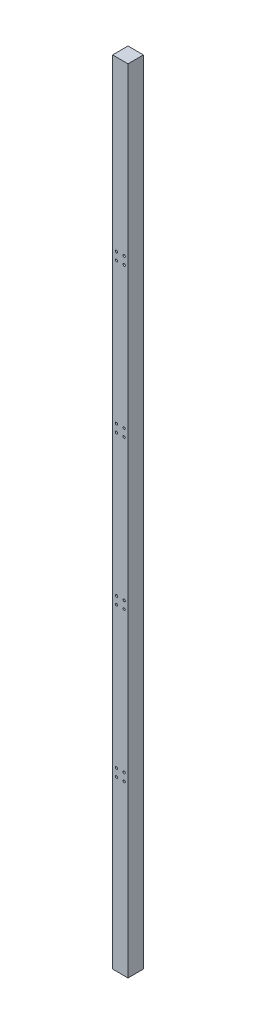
ISO-10303-21;
HEADER;
FILE_DESCRIPTION(('STEP AP214'),'2;1');
FILE_NAME('part.step','',(''),(''),'','','');
FILE_SCHEMA(('AUTOMOTIVE_DESIGN { 1 0 10303 214 1 1 1 1 }'));
ENDSEC;
DATA;
#1=APPLICATION_CONTEXT('core data for automotive mechanical design processes');
#2=APPLICATION_PROTOCOL_DEFINITION('international standard','automotive_design',2000,#1);
#3=PRODUCT_CONTEXT('',#1,'mechanical');
#4=PRODUCT('Part','Part','',(#3));
#5=PRODUCT_RELATED_PRODUCT_CATEGORY('part','',(#4));
#6=PRODUCT_DEFINITION_FORMATION('','',#4);
#7=PRODUCT_DEFINITION_CONTEXT('part definition',#1,'design');
#8=PRODUCT_DEFINITION('design','',#6,#7);
#9=PRODUCT_DEFINITION_SHAPE('','',#8);
#10=(LENGTH_UNIT() NAMED_UNIT(*) SI_UNIT(.MILLI.,.METRE.));
#11=(NAMED_UNIT(*) PLANE_ANGLE_UNIT() SI_UNIT($,.RADIAN.));
#12=(NAMED_UNIT(*) SI_UNIT($,.STERADIAN.) SOLID_ANGLE_UNIT());
#13=UNCERTAINTY_MEASURE_WITH_UNIT(LENGTH_MEASURE(1.E-05),#10,'distance_accuracy_value','');
#14=(GEOMETRIC_REPRESENTATION_CONTEXT(3) GLOBAL_UNCERTAINTY_ASSIGNED_CONTEXT((#13)) GLOBAL_UNIT_ASSIGNED_CONTEXT((#10,
#11,#12)) REPRESENTATION_CONTEXT('',''));
#15=CARTESIAN_POINT('',(0.,0.,0.));
#16=DIRECTION('',(0.,0.,1.));
#17=DIRECTION('',(1.,0.,0.));
#18=AXIS2_PLACEMENT_3D('',#15,#16,#17);
#19=CARTESIAN_POINT('',(-30.,3080.,-30.));
#20=DIRECTION('',(0.,0.,1.));
#21=DIRECTION('',(1.,0.,0.));
#22=AXIS2_PLACEMENT_3D('',#19,#20,#21);
#23=PLANE('',#22);
#24=CARTESIAN_POINT('',(-15.,655.,-30.));
#25=DIRECTION('',(0.,0.,-1.));
#26=DIRECTION('',(-1.,0.,0.));
#27=AXIS2_PLACEMENT_3D('',#24,#25,#26);
#28=CIRCLE('',#27,7.5);
#29=CARTESIAN_POINT('',(-22.5,655.,-30.));
#30=VERTEX_POINT('',#29);
#31=EDGE_CURVE('E309',#30,#30,#28,.T.);
#32=ORIENTED_EDGE('',*,*,#31,.F.);
#33=EDGE_LOOP('',(#32));
#34=FACE_BOUND('',#33,.T.);
#35=CARTESIAN_POINT('',(15.,655.,-30.));
#36=DIRECTION('',(0.,0.,-1.));
#37=DIRECTION('',(-1.,0.,0.));
#38=AXIS2_PLACEMENT_3D('',#35,#36,#37);
#39=CIRCLE('',#38,7.5);
#40=CARTESIAN_POINT('',(7.5,655.,-30.));
#41=VERTEX_POINT('',#40);
#42=EDGE_CURVE('E297',#41,#41,#39,.T.);
#43=ORIENTED_EDGE('',*,*,#42,.F.);
#44=EDGE_LOOP('',(#43));
#45=FACE_BOUND('',#44,.T.);
#46=CARTESIAN_POINT('',(15.0000000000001,685.,-30.));
#47=DIRECTION('',(0.,0.,-1.));
#48=DIRECTION('',(-1.,0.,0.));
#49=AXIS2_PLACEMENT_3D('',#46,#47,#48);
#50=CIRCLE('',#49,7.5);
#51=CARTESIAN_POINT('',(7.50000000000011,685.,-30.));
#52=VERTEX_POINT('',#51);
#53=EDGE_CURVE('E285',#52,#52,#50,.T.);
#54=ORIENTED_EDGE('',*,*,#53,.F.);
#55=EDGE_LOOP('',(#54));
#56=FACE_BOUND('',#55,.T.);
#57=CARTESIAN_POINT('',(-14.9999999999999,685.,-30.));
#58=DIRECTION('',(0.,0.,-1.));
#59=DIRECTION('',(-1.,0.,0.));
#60=AXIS2_PLACEMENT_3D('',#57,#58,#59);
#61=CIRCLE('',#60,7.5);
#62=CARTESIAN_POINT('',(-22.4999999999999,685.,-30.));
#63=VERTEX_POINT('',#62);
#64=EDGE_CURVE('E273',#63,#63,#61,.T.);
#65=ORIENTED_EDGE('',*,*,#64,.F.);
#66=EDGE_LOOP('',(#65));
#67=FACE_BOUND('',#66,.T.);
#68=CARTESIAN_POINT('',(15.0000000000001,1235.,-30.));
#69=DIRECTION('',(0.,0.,-1.));
#70=DIRECTION('',(-1.,0.,0.));
#71=AXIS2_PLACEMENT_3D('',#68,#69,#70);
#72=CIRCLE('',#71,7.49999999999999);
#73=CARTESIAN_POINT('',(7.50000000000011,1235.,-30.));
#74=VERTEX_POINT('',#73);
#75=EDGE_CURVE('E249',#74,#74,#72,.T.);
#76=ORIENTED_EDGE('',*,*,#75,.F.);
#77=EDGE_LOOP('',(#76));
#78=FACE_BOUND('',#77,.T.);
#79=CARTESIAN_POINT('',(15.0000000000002,1265.,-30.));
#80=DIRECTION('',(0.,0.,-1.));
#81=DIRECTION('',(-1.,0.,0.));
#82=AXIS2_PLACEMENT_3D('',#79,#80,#81);
#83=CIRCLE('',#82,7.49999999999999);
#84=CARTESIAN_POINT('',(7.50000000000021,1265.,-30.));
#85=VERTEX_POINT('',#84);
#86=EDGE_CURVE('E237',#85,#85,#83,.T.);
#87=ORIENTED_EDGE('',*,*,#86,.F.);
#88=EDGE_LOOP('',(#87));
#89=FACE_BOUND('',#88,.T.);
#90=CARTESIAN_POINT('',(-14.9999999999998,1265.,-30.));
#91=DIRECTION('',(0.,0.,-1.));
#92=DIRECTION('',(-1.,0.,0.));
#93=AXIS2_PLACEMENT_3D('',#90,#91,#92);
#94=CIRCLE('',#93,7.5);
#95=CARTESIAN_POINT('',(-22.4999999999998,1265.,-30.));
#96=VERTEX_POINT('',#95);
#97=EDGE_CURVE('E225',#96,#96,#94,.T.);
#98=ORIENTED_EDGE('',*,*,#97,.F.);
#99=EDGE_LOOP('',(#98));
#100=FACE_BOUND('',#99,.T.);
#101=CARTESIAN_POINT('',(-14.9999999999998,1815.,-30.));
#102=DIRECTION('',(0.,0.,-1.));
#103=DIRECTION('',(-1.,0.,0.));
#104=AXIS2_PLACEMENT_3D('',#101,#102,#103);
#105=CIRCLE('',#104,7.5);
#106=CARTESIAN_POINT('',(-22.4999999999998,1815.,-30.));
#107=VERTEX_POINT('',#106);
#108=EDGE_CURVE('E213',#107,#107,#105,.T.);
#109=ORIENTED_EDGE('',*,*,#108,.F.);
#110=EDGE_LOOP('',(#109));
#111=FACE_BOUND('',#110,.T.);
#112=CARTESIAN_POINT('',(15.0000000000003,1845.,-30.));
#113=DIRECTION('',(0.,0.,-1.));
#114=DIRECTION('',(-1.,0.,0.));
#115=AXIS2_PLACEMENT_3D('',#112,#113,#114);
#116=CIRCLE('',#115,7.5);
#117=CARTESIAN_POINT('',(7.50000000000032,1845.,-30.));
#118=VERTEX_POINT('',#117);
#119=EDGE_CURVE('E189',#118,#118,#116,.T.);
#120=ORIENTED_EDGE('',*,*,#119,.F.);
#121=EDGE_LOOP('',(#120));
#122=FACE_BOUND('',#121,.T.);
#123=CARTESIAN_POINT('',(-14.9999999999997,2395.,-30.));
#124=DIRECTION('',(0.,0.,-1.));
#125=DIRECTION('',(-1.,0.,0.));
#126=AXIS2_PLACEMENT_3D('',#123,#124,#125);
#127=CIRCLE('',#126,7.5);
#128=CARTESIAN_POINT('',(-22.4999999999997,2395.,-30.));
#129=VERTEX_POINT('',#128);
#130=EDGE_CURVE('E165',#129,#129,#127,.T.);
#131=ORIENTED_EDGE('',*,*,#130,.F.);
#132=EDGE_LOOP('',(#131));
#133=FACE_BOUND('',#132,.T.);
#134=CARTESIAN_POINT('',(15.0000000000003,2395.,-30.));
#135=DIRECTION('',(0.,0.,-1.));
#136=DIRECTION('',(-1.,0.,0.));
#137=AXIS2_PLACEMENT_3D('',#134,#135,#136);
#138=CIRCLE('',#137,7.5);
#139=CARTESIAN_POINT('',(7.50000000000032,2395.,-30.));
#140=VERTEX_POINT('',#139);
#141=EDGE_CURVE('E153',#140,#140,#138,.T.);
#142=ORIENTED_EDGE('',*,*,#141,.F.);
#143=EDGE_LOOP('',(#142));
#144=FACE_BOUND('',#143,.T.);
#145=CARTESIAN_POINT('',(15.0000000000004,2425.,-30.));
#146=DIRECTION('',(0.,0.,-1.));
#147=DIRECTION('',(-1.,0.,0.));
#148=AXIS2_PLACEMENT_3D('',#145,#146,#147);
#149=CIRCLE('',#148,7.5);
#150=CARTESIAN_POINT('',(7.50000000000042,2425.,-30.));
#151=VERTEX_POINT('',#150);
#152=EDGE_CURVE('E141',#151,#151,#149,.T.);
#153=ORIENTED_EDGE('',*,*,#152,.F.);
#154=EDGE_LOOP('',(#153));
#155=FACE_BOUND('',#154,.T.);
#156=CARTESIAN_POINT('',(-14.9999999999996,2425.,-30.));
#157=DIRECTION('',(0.,0.,-1.));
#158=DIRECTION('',(-1.,0.,0.));
#159=AXIS2_PLACEMENT_3D('',#156,#157,#158);
#160=CIRCLE('',#159,7.5);
#161=CARTESIAN_POINT('',(-22.4999999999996,2425.,-30.));
#162=VERTEX_POINT('',#161);
#163=EDGE_CURVE('E129',#162,#162,#160,.T.);
#164=ORIENTED_EDGE('',*,*,#163,.F.);
#165=EDGE_LOOP('',(#164));
#166=FACE_BOUND('',#165,.T.);
#167=DIRECTION('',(-1.,0.,0.));
#168=VECTOR('',#167,1.);
#169=CARTESIAN_POINT('',(-30.,0.,-30.));
#170=LINE('',#169,#168);
#171=CARTESIAN_POINT('',(30.,0.,-30.));
#172=VERTEX_POINT('',#171);
#173=CARTESIAN_POINT('',(-30.,0.,-30.));
#174=VERTEX_POINT('',#173);
#175=EDGE_CURVE('E99',#172,#174,#170,.T.);
#176=ORIENTED_EDGE('',*,*,#175,.T.);
#177=DIRECTION('',(0.,-1.,0.));
#178=VECTOR('',#177,1.);
#179=CARTESIAN_POINT('',(-30.,3080.,-30.));
#180=LINE('',#179,#178);
#181=CARTESIAN_POINT('',(-30.,3080.,-30.));
#182=VERTEX_POINT('',#181);
#183=EDGE_CURVE('E52',#182,#174,#180,.T.);
#184=ORIENTED_EDGE('',*,*,#183,.F.);
#185=DIRECTION('',(-1.,0.,0.));
#186=VECTOR('',#185,1.);
#187=CARTESIAN_POINT('',(-30.,3080.,-30.));
#188=LINE('',#187,#186);
#189=CARTESIAN_POINT('',(30.,3080.,-30.));
#190=VERTEX_POINT('',#189);
#191=EDGE_CURVE('E90',#190,#182,#188,.T.);
#192=ORIENTED_EDGE('',*,*,#191,.F.);
#193=DIRECTION('',(0.,-1.,0.));
#194=VECTOR('',#193,1.);
#195=CARTESIAN_POINT('',(30.,3080.,-30.));
#196=LINE('',#195,#194);
#197=EDGE_CURVE('E11',#190,#172,#196,.T.);
#198=ORIENTED_EDGE('',*,*,#197,.T.);
#199=EDGE_LOOP('',(#176,#184,#192,#198));
#200=FACE_BOUND('',#199,.T.);
#201=CARTESIAN_POINT('',(-14.9999999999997,1845.,-30.));
#202=DIRECTION('',(0.,0.,-1.));
#203=DIRECTION('',(-1.,0.,0.));
#204=AXIS2_PLACEMENT_3D('',#201,#202,#203);
#205=CIRCLE('',#204,7.5);
#206=CARTESIAN_POINT('',(-22.4999999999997,1845.,-30.));
#207=VERTEX_POINT('',#206);
#208=EDGE_CURVE('E177',#207,#207,#205,.T.);
#209=ORIENTED_EDGE('',*,*,#208,.F.);
#210=EDGE_LOOP('',(#209));
#211=FACE_BOUND('',#210,.T.);
#212=CARTESIAN_POINT('',(15.0000000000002,1815.,-30.));
#213=DIRECTION('',(0.,0.,-1.));
#214=DIRECTION('',(-1.,0.,0.));
#215=AXIS2_PLACEMENT_3D('',#212,#213,#214);
#216=CIRCLE('',#215,7.5);
#217=CARTESIAN_POINT('',(7.50000000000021,1815.,-30.));
#218=VERTEX_POINT('',#217);
#219=EDGE_CURVE('E201',#218,#218,#216,.T.);
#220=ORIENTED_EDGE('',*,*,#219,.F.);
#221=EDGE_LOOP('',(#220));
#222=FACE_BOUND('',#221,.T.);
#223=CARTESIAN_POINT('',(-14.9999999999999,1235.,-30.));
#224=DIRECTION('',(0.,0.,-1.));
#225=DIRECTION('',(-1.,0.,0.));
#226=AXIS2_PLACEMENT_3D('',#223,#224,#225);
#227=CIRCLE('',#226,7.5);
#228=CARTESIAN_POINT('',(-22.4999999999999,1235.,-30.));
#229=VERTEX_POINT('',#228);
#230=EDGE_CURVE('E261',#229,#229,#227,.T.);
#231=ORIENTED_EDGE('',*,*,#230,.F.);
#232=EDGE_LOOP('',(#231));
#233=FACE_BOUND('',#232,.T.);
#234=ADVANCED_FACE('F43',(#34,#45,#56,#67,#78,#89,#100,#111,#122,#133,#144,#155,#166,#200,#211,
#222,#233),#23,.F.);
#235=CARTESIAN_POINT('',(30.,3080.,-30.));
#236=DIRECTION('',(-1.,0.,0.));
#237=DIRECTION('',(0.,0.,1.));
#238=AXIS2_PLACEMENT_3D('',#235,#236,#237);
#239=PLANE('',#238);
#240=DIRECTION('',(0.,0.,-1.));
#241=VECTOR('',#240,1.);
#242=CARTESIAN_POINT('',(30.,0.,-30.));
#243=LINE('',#242,#241);
#244=CARTESIAN_POINT('',(30.,0.,30.));
#245=VERTEX_POINT('',#244);
#246=EDGE_CURVE('E107',#245,#172,#243,.T.);
#247=ORIENTED_EDGE('',*,*,#246,.T.);
#248=ORIENTED_EDGE('',*,*,#197,.F.);
#249=DIRECTION('',(0.,0.,-1.));
#250=VECTOR('',#249,1.);
#251=CARTESIAN_POINT('',(30.,3080.,-30.));
#252=LINE('',#251,#250);
#253=CARTESIAN_POINT('',(30.,3080.,30.));
#254=VERTEX_POINT('',#253);
#255=EDGE_CURVE('E95',#254,#190,#252,.T.);
#256=ORIENTED_EDGE('',*,*,#255,.F.);
#257=DIRECTION('',(0.,-1.,0.));
#258=VECTOR('',#257,1.);
#259=CARTESIAN_POINT('',(30.,3080.,30.));
#260=LINE('',#259,#258);
#261=EDGE_CURVE('E103',#254,#245,#260,.T.);
#262=ORIENTED_EDGE('',*,*,#261,.T.);
#263=EDGE_LOOP('',(#247,#248,#256,#262));
#264=FACE_BOUND('',#263,.T.);
#265=ADVANCED_FACE('F45',(#264),#239,.F.);
#266=CARTESIAN_POINT('',(-30.,3080.,-30.));
#267=DIRECTION('',(1.,0.,0.));
#268=DIRECTION('',(0.,0.,-1.));
#269=AXIS2_PLACEMENT_3D('',#266,#267,#268);
#270=PLANE('',#269);
#271=DIRECTION('',(0.,0.,1.));
#272=VECTOR('',#271,1.);
#273=CARTESIAN_POINT('',(-30.,0.,-30.));
#274=LINE('',#273,#272);
#275=CARTESIAN_POINT('',(-30.,0.,30.));
#276=VERTEX_POINT('',#275);
#277=EDGE_CURVE('E77',#174,#276,#274,.T.);
#278=ORIENTED_EDGE('',*,*,#277,.T.);
#279=DIRECTION('',(0.,-1.,0.));
#280=VECTOR('',#279,1.);
#281=CARTESIAN_POINT('',(-30.,3080.,30.));
#282=LINE('',#281,#280);
#283=CARTESIAN_POINT('',(-30.,3080.,30.));
#284=VERTEX_POINT('',#283);
#285=EDGE_CURVE('E100',#284,#276,#282,.T.);
#286=ORIENTED_EDGE('',*,*,#285,.F.);
#287=DIRECTION('',(0.,0.,1.));
#288=VECTOR('',#287,1.);
#289=CARTESIAN_POINT('',(-30.,3080.,-30.));
#290=LINE('',#289,#288);
#291=EDGE_CURVE('E93',#182,#284,#290,.T.);
#292=ORIENTED_EDGE('',*,*,#291,.F.);
#293=ORIENTED_EDGE('',*,*,#183,.T.);
#294=EDGE_LOOP('',(#278,#286,#292,#293));
#295=FACE_BOUND('',#294,.T.);
#296=ADVANCED_FACE('F101',(#295),#270,.F.);
#297=CARTESIAN_POINT('',(-30.,3080.,30.));
#298=DIRECTION('',(0.,0.,-1.));
#299=DIRECTION('',(-1.,0.,0.));
#300=AXIS2_PLACEMENT_3D('',#297,#298,#299);
#301=PLANE('',#300);
#302=CARTESIAN_POINT('',(-15.,655.,30.));
#303=DIRECTION('',(0.,0.,-1.));
#304=DIRECTION('',(-1.,0.,0.));
#305=AXIS2_PLACEMENT_3D('',#302,#303,#304);
#306=CIRCLE('',#305,4.49999999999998);
#307=CARTESIAN_POINT('',(-19.5,655.,30.));
#308=VERTEX_POINT('',#307);
#309=EDGE_CURVE('E300',#308,#308,#306,.T.);
#310=ORIENTED_EDGE('',*,*,#309,.T.);
#311=EDGE_LOOP('',(#310));
#312=FACE_BOUND('',#311,.T.);
#313=CARTESIAN_POINT('',(15.,655.,30.));
#314=DIRECTION('',(0.,0.,-1.));
#315=DIRECTION('',(-1.,0.,0.));
#316=AXIS2_PLACEMENT_3D('',#313,#314,#315);
#317=CIRCLE('',#316,4.49999999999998);
#318=CARTESIAN_POINT('',(10.5,655.,30.));
#319=VERTEX_POINT('',#318);
#320=EDGE_CURVE('E288',#319,#319,#317,.T.);
#321=ORIENTED_EDGE('',*,*,#320,.T.);
#322=EDGE_LOOP('',(#321));
#323=FACE_BOUND('',#322,.T.);
#324=CARTESIAN_POINT('',(15.0000000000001,685.,30.));
#325=DIRECTION('',(0.,0.,-1.));
#326=DIRECTION('',(-1.,0.,0.));
#327=AXIS2_PLACEMENT_3D('',#324,#325,#326);
#328=CIRCLE('',#327,4.49999999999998);
#329=CARTESIAN_POINT('',(10.5000000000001,685.,30.));
#330=VERTEX_POINT('',#329);
#331=EDGE_CURVE('E276',#330,#330,#328,.T.);
#332=ORIENTED_EDGE('',*,*,#331,.T.);
#333=EDGE_LOOP('',(#332));
#334=FACE_BOUND('',#333,.T.);
#335=CARTESIAN_POINT('',(-14.9999999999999,685.,30.));
#336=DIRECTION('',(0.,0.,-1.));
#337=DIRECTION('',(-1.,0.,0.));
#338=AXIS2_PLACEMENT_3D('',#335,#336,#337);
#339=CIRCLE('',#338,4.49999999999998);
#340=CARTESIAN_POINT('',(-19.4999999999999,685.,30.));
#341=VERTEX_POINT('',#340);
#342=EDGE_CURVE('E264',#341,#341,#339,.T.);
#343=ORIENTED_EDGE('',*,*,#342,.T.);
#344=EDGE_LOOP('',(#343));
#345=FACE_BOUND('',#344,.T.);
#346=CARTESIAN_POINT('',(-14.9999999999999,1235.,30.));
#347=DIRECTION('',(0.,0.,-1.));
#348=DIRECTION('',(-1.,0.,0.));
#349=AXIS2_PLACEMENT_3D('',#346,#347,#348);
#350=CIRCLE('',#349,4.49999999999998);
#351=CARTESIAN_POINT('',(-19.4999999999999,1235.,30.));
#352=VERTEX_POINT('',#351);
#353=EDGE_CURVE('E252',#352,#352,#350,.T.);
#354=ORIENTED_EDGE('',*,*,#353,.T.);
#355=EDGE_LOOP('',(#354));
#356=FACE_BOUND('',#355,.T.);
#357=CARTESIAN_POINT('',(15.0000000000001,1235.,30.));
#358=DIRECTION('',(0.,0.,-1.));
#359=DIRECTION('',(-1.,0.,0.));
#360=AXIS2_PLACEMENT_3D('',#357,#358,#359);
#361=CIRCLE('',#360,4.49999999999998);
#362=CARTESIAN_POINT('',(10.5000000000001,1235.,30.));
#363=VERTEX_POINT('',#362);
#364=EDGE_CURVE('E240',#363,#363,#361,.T.);
#365=ORIENTED_EDGE('',*,*,#364,.T.);
#366=EDGE_LOOP('',(#365));
#367=FACE_BOUND('',#366,.T.);
#368=CARTESIAN_POINT('',(15.0000000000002,1265.,30.));
#369=DIRECTION('',(0.,0.,-1.));
#370=DIRECTION('',(-1.,0.,0.));
#371=AXIS2_PLACEMENT_3D('',#368,#369,#370);
#372=CIRCLE('',#371,4.49999999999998);
#373=CARTESIAN_POINT('',(10.5000000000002,1265.,30.));
#374=VERTEX_POINT('',#373);
#375=EDGE_CURVE('E228',#374,#374,#372,.T.);
#376=ORIENTED_EDGE('',*,*,#375,.T.);
#377=EDGE_LOOP('',(#376));
#378=FACE_BOUND('',#377,.T.);
#379=CARTESIAN_POINT('',(-14.9999999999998,1265.,30.));
#380=DIRECTION('',(0.,0.,-1.));
#381=DIRECTION('',(-1.,0.,0.));
#382=AXIS2_PLACEMENT_3D('',#379,#380,#381);
#383=CIRCLE('',#382,4.49999999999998);
#384=CARTESIAN_POINT('',(-19.4999999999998,1265.,30.));
#385=VERTEX_POINT('',#384);
#386=EDGE_CURVE('E216',#385,#385,#383,.T.);
#387=ORIENTED_EDGE('',*,*,#386,.T.);
#388=EDGE_LOOP('',(#387));
#389=FACE_BOUND('',#388,.T.);
#390=CARTESIAN_POINT('',(-14.9999999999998,1815.,30.));
#391=DIRECTION('',(0.,0.,-1.));
#392=DIRECTION('',(-1.,0.,0.));
#393=AXIS2_PLACEMENT_3D('',#390,#391,#392);
#394=CIRCLE('',#393,4.49999999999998);
#395=CARTESIAN_POINT('',(-19.4999999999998,1815.,30.));
#396=VERTEX_POINT('',#395);
#397=EDGE_CURVE('E204',#396,#396,#394,.T.);
#398=ORIENTED_EDGE('',*,*,#397,.T.);
#399=EDGE_LOOP('',(#398));
#400=FACE_BOUND('',#399,.T.);
#401=CARTESIAN_POINT('',(15.0000000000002,1815.,30.));
#402=DIRECTION('',(0.,0.,-1.));
#403=DIRECTION('',(-1.,0.,0.));
#404=AXIS2_PLACEMENT_3D('',#401,#402,#403);
#405=CIRCLE('',#404,4.49999999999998);
#406=CARTESIAN_POINT('',(10.5000000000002,1815.,30.));
#407=VERTEX_POINT('',#406);
#408=EDGE_CURVE('E192',#407,#407,#405,.T.);
#409=ORIENTED_EDGE('',*,*,#408,.T.);
#410=EDGE_LOOP('',(#409));
#411=FACE_BOUND('',#410,.T.);
#412=CARTESIAN_POINT('',(15.0000000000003,1845.,30.));
#413=DIRECTION('',(0.,0.,-1.));
#414=DIRECTION('',(-1.,0.,0.));
#415=AXIS2_PLACEMENT_3D('',#412,#413,#414);
#416=CIRCLE('',#415,4.49999999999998);
#417=CARTESIAN_POINT('',(10.5000000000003,1845.,30.));
#418=VERTEX_POINT('',#417);
#419=EDGE_CURVE('E180',#418,#418,#416,.T.);
#420=ORIENTED_EDGE('',*,*,#419,.T.);
#421=EDGE_LOOP('',(#420));
#422=FACE_BOUND('',#421,.T.);
#423=CARTESIAN_POINT('',(-14.9999999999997,1845.,30.));
#424=DIRECTION('',(0.,0.,-1.));
#425=DIRECTION('',(-1.,0.,0.));
#426=AXIS2_PLACEMENT_3D('',#423,#424,#425);
#427=CIRCLE('',#426,4.49999999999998);
#428=CARTESIAN_POINT('',(-19.4999999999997,1845.,30.));
#429=VERTEX_POINT('',#428);
#430=EDGE_CURVE('E168',#429,#429,#427,.T.);
#431=ORIENTED_EDGE('',*,*,#430,.T.);
#432=EDGE_LOOP('',(#431));
#433=FACE_BOUND('',#432,.T.);
#434=CARTESIAN_POINT('',(-14.9999999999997,2395.,30.));
#435=DIRECTION('',(0.,0.,-1.));
#436=DIRECTION('',(-1.,0.,0.));
#437=AXIS2_PLACEMENT_3D('',#434,#435,#436);
#438=CIRCLE('',#437,4.49999999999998);
#439=CARTESIAN_POINT('',(-19.4999999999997,2395.,30.));
#440=VERTEX_POINT('',#439);
#441=EDGE_CURVE('E156',#440,#440,#438,.T.);
#442=ORIENTED_EDGE('',*,*,#441,.T.);
#443=EDGE_LOOP('',(#442));
#444=FACE_BOUND('',#443,.T.);
#445=CARTESIAN_POINT('',(15.0000000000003,2395.,30.));
#446=DIRECTION('',(0.,0.,-1.));
#447=DIRECTION('',(-1.,0.,0.));
#448=AXIS2_PLACEMENT_3D('',#445,#446,#447);
#449=CIRCLE('',#448,4.49999999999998);
#450=CARTESIAN_POINT('',(10.5000000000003,2395.,30.));
#451=VERTEX_POINT('',#450);
#452=EDGE_CURVE('E144',#451,#451,#449,.T.);
#453=ORIENTED_EDGE('',*,*,#452,.T.);
#454=EDGE_LOOP('',(#453));
#455=FACE_BOUND('',#454,.T.);
#456=CARTESIAN_POINT('',(15.0000000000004,2425.,30.));
#457=DIRECTION('',(0.,0.,-1.));
#458=DIRECTION('',(-1.,0.,0.));
#459=AXIS2_PLACEMENT_3D('',#456,#457,#458);
#460=CIRCLE('',#459,4.49999999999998);
#461=CARTESIAN_POINT('',(10.5000000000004,2425.,30.));
#462=VERTEX_POINT('',#461);
#463=EDGE_CURVE('E132',#462,#462,#460,.T.);
#464=ORIENTED_EDGE('',*,*,#463,.T.);
#465=EDGE_LOOP('',(#464));
#466=FACE_BOUND('',#465,.T.);
#467=CARTESIAN_POINT('',(-14.9999999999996,2425.,30.));
#468=DIRECTION('',(0.,0.,-1.));
#469=DIRECTION('',(-1.,0.,0.));
#470=AXIS2_PLACEMENT_3D('',#467,#468,#469);
#471=CIRCLE('',#470,4.49999999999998);
#472=CARTESIAN_POINT('',(-19.4999999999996,2425.,30.));
#473=VERTEX_POINT('',#472);
#474=EDGE_CURVE('E110',#473,#473,#471,.T.);
#475=ORIENTED_EDGE('',*,*,#474,.T.);
#476=EDGE_LOOP('',(#475));
#477=FACE_BOUND('',#476,.T.);
#478=DIRECTION('',(1.,0.,0.));
#479=VECTOR('',#478,1.);
#480=CARTESIAN_POINT('',(-30.,0.,30.));
#481=LINE('',#480,#479);
#482=EDGE_CURVE('E83',#276,#245,#481,.T.);
#483=ORIENTED_EDGE('',*,*,#482,.T.);
#484=ORIENTED_EDGE('',*,*,#261,.F.);
#485=DIRECTION('',(1.,0.,0.));
#486=VECTOR('',#485,1.);
#487=CARTESIAN_POINT('',(-30.,3080.,30.));
#488=LINE('',#487,#486);
#489=EDGE_CURVE('E60',#284,#254,#488,.T.);
#490=ORIENTED_EDGE('',*,*,#489,.F.);
#491=ORIENTED_EDGE('',*,*,#285,.T.);
#492=EDGE_LOOP('',(#483,#484,#490,#491));
#493=FACE_BOUND('',#492,.T.);
#494=ADVANCED_FACE('F115',(#312,#323,#334,#345,#356,#367,#378,#389,#400,#411,#422,#433,#444,
#455,#466,#477,#493),#301,.F.);
#495=CARTESIAN_POINT('',(0.,3080.,0.));
#496=DIRECTION('',(0.,1.,0.));
#497=DIRECTION('',(0.,0.,1.));
#498=AXIS2_PLACEMENT_3D('',#495,#496,#497);
#499=PLANE('',#498);
#500=ORIENTED_EDGE('',*,*,#255,.T.);
#501=ORIENTED_EDGE('',*,*,#191,.T.);
#502=ORIENTED_EDGE('',*,*,#291,.T.);
#503=ORIENTED_EDGE('',*,*,#489,.T.);
#504=EDGE_LOOP('',(#500,#501,#502,#503));
#505=FACE_BOUND('',#504,.T.);
#506=ADVANCED_FACE('F91',(#505),#499,.T.);
#507=CARTESIAN_POINT('',(0.,0.,0.));
#508=DIRECTION('',(0.,1.,0.));
#509=DIRECTION('',(0.,0.,1.));
#510=AXIS2_PLACEMENT_3D('',#507,#508,#509);
#511=PLANE('',#510);
#512=ORIENTED_EDGE('',*,*,#246,.F.);
#513=ORIENTED_EDGE('',*,*,#482,.F.);
#514=ORIENTED_EDGE('',*,*,#277,.F.);
#515=ORIENTED_EDGE('',*,*,#175,.F.);
#516=EDGE_LOOP('',(#512,#513,#514,#515));
#517=FACE_BOUND('',#516,.T.);
#518=ADVANCED_FACE('F118',(#517),#511,.F.);
#519=CARTESIAN_POINT('',(-14.9999999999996,2425.,-30.));
#520=DIRECTION('',(0.,0.,-1.));
#521=DIRECTION('',(-1.,0.,0.));
#522=AXIS2_PLACEMENT_3D('',#519,#520,#521);
#523=CYLINDRICAL_SURFACE('',#522,4.5);
#524=ORIENTED_EDGE('',*,*,#474,.F.);
#525=EDGE_LOOP('',(#524));
#526=FACE_BOUND('',#525,.T.);
#527=CARTESIAN_POINT('',(-14.9999999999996,2425.,-24.));
#528=DIRECTION('',(0.,0.,-1.));
#529=DIRECTION('',(-1.,0.,0.));
#530=AXIS2_PLACEMENT_3D('',#527,#528,#529);
#531=CIRCLE('',#530,4.50000000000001);
#532=CARTESIAN_POINT('',(-19.4999999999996,2425.,-24.));
#533=VERTEX_POINT('',#532);
#534=EDGE_CURVE('E123',#533,#533,#531,.T.);
#535=ORIENTED_EDGE('',*,*,#534,.T.);
#536=EDGE_LOOP('',(#535));
#537=FACE_BOUND('',#536,.T.);
#538=ADVANCED_FACE('F354',(#526,#537),#523,.F.);
#539=CARTESIAN_POINT('',(-10.4999999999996,2425.,-24.));
#540=DIRECTION('',(0.,0.,1.));
#541=DIRECTION('',(1.,0.,0.));
#542=AXIS2_PLACEMENT_3D('',#539,#540,#541);
#543=PLANE('',#542);
#544=ORIENTED_EDGE('',*,*,#534,.F.);
#545=EDGE_LOOP('',(#544));
#546=FACE_BOUND('',#545,.T.);
#547=CARTESIAN_POINT('',(-14.9999999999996,2425.,-24.));
#548=DIRECTION('',(0.,0.,-1.));
#549=DIRECTION('',(-1.,0.,0.));
#550=AXIS2_PLACEMENT_3D('',#547,#548,#549);
#551=CIRCLE('',#550,7.5);
#552=CARTESIAN_POINT('',(-22.4999999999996,2425.,-24.));
#553=VERTEX_POINT('',#552);
#554=EDGE_CURVE('E126',#553,#553,#551,.T.);
#555=ORIENTED_EDGE('',*,*,#554,.T.);
#556=EDGE_LOOP('',(#555));
#557=FACE_BOUND('',#556,.T.);
#558=ADVANCED_FACE('F344',(#546,#557),#543,.F.);
#559=CARTESIAN_POINT('',(-14.9999999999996,2425.,-30.));
#560=DIRECTION('',(0.,0.,-1.));
#561=DIRECTION('',(-1.,0.,0.));
#562=AXIS2_PLACEMENT_3D('',#559,#560,#561);
#563=CYLINDRICAL_SURFACE('',#562,7.5);
#564=ORIENTED_EDGE('',*,*,#554,.F.);
#565=EDGE_LOOP('',(#564));
#566=FACE_BOUND('',#565,.T.);
#567=ORIENTED_EDGE('',*,*,#163,.T.);
#568=EDGE_LOOP('',(#567));
#569=FACE_BOUND('',#568,.T.);
#570=ADVANCED_FACE('F341',(#566,#569),#563,.F.);
#571=CARTESIAN_POINT('',(15.0000000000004,2425.,-30.));
#572=DIRECTION('',(0.,0.,-1.));
#573=DIRECTION('',(-1.,0.,0.));
#574=AXIS2_PLACEMENT_3D('',#571,#572,#573);
#575=CYLINDRICAL_SURFACE('',#574,4.5);
#576=ORIENTED_EDGE('',*,*,#463,.F.);
#577=EDGE_LOOP('',(#576));
#578=FACE_BOUND('',#577,.T.);
#579=CARTESIAN_POINT('',(15.0000000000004,2425.,-24.));
#580=DIRECTION('',(0.,0.,-1.));
#581=DIRECTION('',(-1.,0.,0.));
#582=AXIS2_PLACEMENT_3D('',#579,#580,#581);
#583=CIRCLE('',#582,4.50000000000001);
#584=CARTESIAN_POINT('',(10.5000000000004,2425.,-24.));
#585=VERTEX_POINT('',#584);
#586=EDGE_CURVE('E135',#585,#585,#583,.T.);
#587=ORIENTED_EDGE('',*,*,#586,.T.);
#588=EDGE_LOOP('',(#587));
#589=FACE_BOUND('',#588,.T.);
#590=ADVANCED_FACE('F343',(#578,#589),#575,.F.);
#591=CARTESIAN_POINT('',(19.5000000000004,2425.,-24.));
#592=DIRECTION('',(0.,0.,1.));
#593=DIRECTION('',(1.,0.,0.));
#594=AXIS2_PLACEMENT_3D('',#591,#592,#593);
#595=PLANE('',#594);
#596=ORIENTED_EDGE('',*,*,#586,.F.);
#597=EDGE_LOOP('',(#596));
#598=FACE_BOUND('',#597,.T.);
#599=CARTESIAN_POINT('',(15.0000000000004,2425.,-24.));
#600=DIRECTION('',(0.,0.,-1.));
#601=DIRECTION('',(-1.,0.,0.));
#602=AXIS2_PLACEMENT_3D('',#599,#600,#601);
#603=CIRCLE('',#602,7.5);
#604=CARTESIAN_POINT('',(7.50000000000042,2425.,-24.));
#605=VERTEX_POINT('',#604);
#606=EDGE_CURVE('E138',#605,#605,#603,.T.);
#607=ORIENTED_EDGE('',*,*,#606,.T.);
#608=EDGE_LOOP('',(#607));
#609=FACE_BOUND('',#608,.T.);
#610=ADVANCED_FACE('F351',(#598,#609),#595,.F.);
#611=CARTESIAN_POINT('',(15.0000000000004,2425.,-30.));
#612=DIRECTION('',(0.,0.,-1.));
#613=DIRECTION('',(-1.,0.,0.));
#614=AXIS2_PLACEMENT_3D('',#611,#612,#613);
#615=CYLINDRICAL_SURFACE('',#614,7.5);
#616=ORIENTED_EDGE('',*,*,#606,.F.);
#617=EDGE_LOOP('',(#616));
#618=FACE_BOUND('',#617,.T.);
#619=ORIENTED_EDGE('',*,*,#152,.T.);
#620=EDGE_LOOP('',(#619));
#621=FACE_BOUND('',#620,.T.);
#622=ADVANCED_FACE('F435',(#618,#621),#615,.F.);
#623=CARTESIAN_POINT('',(15.0000000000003,2395.,-30.));
#624=DIRECTION('',(0.,0.,-1.));
#625=DIRECTION('',(-1.,0.,0.));
#626=AXIS2_PLACEMENT_3D('',#623,#624,#625);
#627=CYLINDRICAL_SURFACE('',#626,4.5);
#628=ORIENTED_EDGE('',*,*,#452,.F.);
#629=EDGE_LOOP('',(#628));
#630=FACE_BOUND('',#629,.T.);
#631=CARTESIAN_POINT('',(15.0000000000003,2395.,-24.));
#632=DIRECTION('',(0.,0.,-1.));
#633=DIRECTION('',(-1.,0.,0.));
#634=AXIS2_PLACEMENT_3D('',#631,#632,#633);
#635=CIRCLE('',#634,4.50000000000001);
#636=CARTESIAN_POINT('',(10.5000000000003,2395.,-24.));
#637=VERTEX_POINT('',#636);
#638=EDGE_CURVE('E147',#637,#637,#635,.T.);
#639=ORIENTED_EDGE('',*,*,#638,.T.);
#640=EDGE_LOOP('',(#639));
#641=FACE_BOUND('',#640,.T.);
#642=ADVANCED_FACE('F444',(#630,#641),#627,.F.);
#643=CARTESIAN_POINT('',(19.5000000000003,2395.,-24.));
#644=DIRECTION('',(0.,0.,1.));
#645=DIRECTION('',(1.,0.,0.));
#646=AXIS2_PLACEMENT_3D('',#643,#644,#645);
#647=PLANE('',#646);
#648=ORIENTED_EDGE('',*,*,#638,.F.);
#649=EDGE_LOOP('',(#648));
#650=FACE_BOUND('',#649,.T.);
#651=CARTESIAN_POINT('',(15.0000000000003,2395.,-24.));
#652=DIRECTION('',(0.,0.,-1.));
#653=DIRECTION('',(-1.,0.,0.));
#654=AXIS2_PLACEMENT_3D('',#651,#652,#653);
#655=CIRCLE('',#654,7.5);
#656=CARTESIAN_POINT('',(7.50000000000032,2395.,-24.));
#657=VERTEX_POINT('',#656);
#658=EDGE_CURVE('E150',#657,#657,#655,.T.);
#659=ORIENTED_EDGE('',*,*,#658,.T.);
#660=EDGE_LOOP('',(#659));
#661=FACE_BOUND('',#660,.T.);
#662=ADVANCED_FACE('F454',(#650,#661),#647,.F.);
#663=CARTESIAN_POINT('',(15.0000000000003,2395.,-30.));
#664=DIRECTION('',(0.,0.,-1.));
#665=DIRECTION('',(-1.,0.,0.));
#666=AXIS2_PLACEMENT_3D('',#663,#664,#665);
#667=CYLINDRICAL_SURFACE('',#666,7.5);
#668=ORIENTED_EDGE('',*,*,#658,.F.);
#669=EDGE_LOOP('',(#668));
#670=FACE_BOUND('',#669,.T.);
#671=ORIENTED_EDGE('',*,*,#141,.T.);
#672=EDGE_LOOP('',(#671));
#673=FACE_BOUND('',#672,.T.);
#674=ADVANCED_FACE('F464',(#670,#673),#667,.F.);
#675=CARTESIAN_POINT('',(-14.9999999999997,2395.,-30.));
#676=DIRECTION('',(0.,0.,-1.));
#677=DIRECTION('',(-1.,0.,0.));
#678=AXIS2_PLACEMENT_3D('',#675,#676,#677);
#679=CYLINDRICAL_SURFACE('',#678,4.5);
#680=ORIENTED_EDGE('',*,*,#441,.F.);
#681=EDGE_LOOP('',(#680));
#682=FACE_BOUND('',#681,.T.);
#683=CARTESIAN_POINT('',(-14.9999999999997,2395.,-24.));
#684=DIRECTION('',(0.,0.,-1.));
#685=DIRECTION('',(-1.,0.,0.));
#686=AXIS2_PLACEMENT_3D('',#683,#684,#685);
#687=CIRCLE('',#686,4.50000000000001);
#688=CARTESIAN_POINT('',(-19.4999999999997,2395.,-24.));
#689=VERTEX_POINT('',#688);
#690=EDGE_CURVE('E159',#689,#689,#687,.T.);
#691=ORIENTED_EDGE('',*,*,#690,.T.);
#692=EDGE_LOOP('',(#691));
#693=FACE_BOUND('',#692,.T.);
#694=ADVANCED_FACE('F474',(#682,#693),#679,.F.);
#695=CARTESIAN_POINT('',(-10.4999999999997,2395.,-24.));
#696=DIRECTION('',(0.,0.,1.));
#697=DIRECTION('',(1.,0.,0.));
#698=AXIS2_PLACEMENT_3D('',#695,#696,#697);
#699=PLANE('',#698);
#700=ORIENTED_EDGE('',*,*,#690,.F.);
#701=EDGE_LOOP('',(#700));
#702=FACE_BOUND('',#701,.T.);
#703=CARTESIAN_POINT('',(-14.9999999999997,2395.,-24.));
#704=DIRECTION('',(0.,0.,-1.));
#705=DIRECTION('',(-1.,0.,0.));
#706=AXIS2_PLACEMENT_3D('',#703,#704,#705);
#707=CIRCLE('',#706,7.5);
#708=CARTESIAN_POINT('',(-22.4999999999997,2395.,-24.));
#709=VERTEX_POINT('',#708);
#710=EDGE_CURVE('E162',#709,#709,#707,.T.);
#711=ORIENTED_EDGE('',*,*,#710,.T.);
#712=EDGE_LOOP('',(#711));
#713=FACE_BOUND('',#712,.T.);
#714=ADVANCED_FACE('F484',(#702,#713),#699,.F.);
#715=CARTESIAN_POINT('',(-14.9999999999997,2395.,-30.));
#716=DIRECTION('',(0.,0.,-1.));
#717=DIRECTION('',(-1.,0.,0.));
#718=AXIS2_PLACEMENT_3D('',#715,#716,#717);
#719=CYLINDRICAL_SURFACE('',#718,7.5);
#720=ORIENTED_EDGE('',*,*,#710,.F.);
#721=EDGE_LOOP('',(#720));
#722=FACE_BOUND('',#721,.T.);
#723=ORIENTED_EDGE('',*,*,#130,.T.);
#724=EDGE_LOOP('',(#723));
#725=FACE_BOUND('',#724,.T.);
#726=ADVANCED_FACE('F494',(#722,#725),#719,.F.);
#727=CARTESIAN_POINT('',(-14.9999999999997,1845.,-30.));
#728=DIRECTION('',(0.,0.,-1.));
#729=DIRECTION('',(-1.,0.,0.));
#730=AXIS2_PLACEMENT_3D('',#727,#728,#729);
#731=CYLINDRICAL_SURFACE('',#730,4.5);
#732=ORIENTED_EDGE('',*,*,#430,.F.);
#733=EDGE_LOOP('',(#732));
#734=FACE_BOUND('',#733,.T.);
#735=CARTESIAN_POINT('',(-14.9999999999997,1845.,-24.));
#736=DIRECTION('',(0.,0.,-1.));
#737=DIRECTION('',(-1.,0.,0.));
#738=AXIS2_PLACEMENT_3D('',#735,#736,#737);
#739=CIRCLE('',#738,4.50000000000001);
#740=CARTESIAN_POINT('',(-19.4999999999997,1845.,-24.));
#741=VERTEX_POINT('',#740);
#742=EDGE_CURVE('E171',#741,#741,#739,.T.);
#743=ORIENTED_EDGE('',*,*,#742,.T.);
#744=EDGE_LOOP('',(#743));
#745=FACE_BOUND('',#744,.T.);
#746=ADVANCED_FACE('F504',(#734,#745),#731,.F.);
#747=CARTESIAN_POINT('',(-10.4999999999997,1845.,-24.));
#748=DIRECTION('',(0.,0.,1.));
#749=DIRECTION('',(1.,0.,0.));
#750=AXIS2_PLACEMENT_3D('',#747,#748,#749);
#751=PLANE('',#750);
#752=ORIENTED_EDGE('',*,*,#742,.F.);
#753=EDGE_LOOP('',(#752));
#754=FACE_BOUND('',#753,.T.);
#755=CARTESIAN_POINT('',(-14.9999999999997,1845.,-24.));
#756=DIRECTION('',(0.,0.,-1.));
#757=DIRECTION('',(-1.,0.,0.));
#758=AXIS2_PLACEMENT_3D('',#755,#756,#757);
#759=CIRCLE('',#758,7.5);
#760=CARTESIAN_POINT('',(-22.4999999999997,1845.,-24.));
#761=VERTEX_POINT('',#760);
#762=EDGE_CURVE('E174',#761,#761,#759,.T.);
#763=ORIENTED_EDGE('',*,*,#762,.T.);
#764=EDGE_LOOP('',(#763));
#765=FACE_BOUND('',#764,.T.);
#766=ADVANCED_FACE('F514',(#754,#765),#751,.F.);
#767=CARTESIAN_POINT('',(-14.9999999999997,1845.,-30.));
#768=DIRECTION('',(0.,0.,-1.));
#769=DIRECTION('',(-1.,0.,0.));
#770=AXIS2_PLACEMENT_3D('',#767,#768,#769);
#771=CYLINDRICAL_SURFACE('',#770,7.5);
#772=ORIENTED_EDGE('',*,*,#762,.F.);
#773=EDGE_LOOP('',(#772));
#774=FACE_BOUND('',#773,.T.);
#775=ORIENTED_EDGE('',*,*,#208,.T.);
#776=EDGE_LOOP('',(#775));
#777=FACE_BOUND('',#776,.T.);
#778=ADVANCED_FACE('F524',(#774,#777),#771,.F.);
#779=CARTESIAN_POINT('',(15.0000000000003,1845.,-30.));
#780=DIRECTION('',(0.,0.,-1.));
#781=DIRECTION('',(-1.,0.,0.));
#782=AXIS2_PLACEMENT_3D('',#779,#780,#781);
#783=CYLINDRICAL_SURFACE('',#782,4.5);
#784=ORIENTED_EDGE('',*,*,#419,.F.);
#785=EDGE_LOOP('',(#784));
#786=FACE_BOUND('',#785,.T.);
#787=CARTESIAN_POINT('',(15.0000000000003,1845.,-24.));
#788=DIRECTION('',(0.,0.,-1.));
#789=DIRECTION('',(-1.,0.,0.));
#790=AXIS2_PLACEMENT_3D('',#787,#788,#789);
#791=CIRCLE('',#790,4.50000000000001);
#792=CARTESIAN_POINT('',(10.5000000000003,1845.,-24.));
#793=VERTEX_POINT('',#792);
#794=EDGE_CURVE('E183',#793,#793,#791,.T.);
#795=ORIENTED_EDGE('',*,*,#794,.T.);
#796=EDGE_LOOP('',(#795));
#797=FACE_BOUND('',#796,.T.);
#798=ADVANCED_FACE('F534',(#786,#797),#783,.F.);
#799=CARTESIAN_POINT('',(19.5000000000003,1845.,-24.));
#800=DIRECTION('',(0.,0.,1.));
#801=DIRECTION('',(1.,0.,0.));
#802=AXIS2_PLACEMENT_3D('',#799,#800,#801);
#803=PLANE('',#802);
#804=ORIENTED_EDGE('',*,*,#794,.F.);
#805=EDGE_LOOP('',(#804));
#806=FACE_BOUND('',#805,.T.);
#807=CARTESIAN_POINT('',(15.0000000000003,1845.,-24.));
#808=DIRECTION('',(0.,0.,-1.));
#809=DIRECTION('',(-1.,0.,0.));
#810=AXIS2_PLACEMENT_3D('',#807,#808,#809);
#811=CIRCLE('',#810,7.5);
#812=CARTESIAN_POINT('',(7.50000000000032,1845.,-24.));
#813=VERTEX_POINT('',#812);
#814=EDGE_CURVE('E186',#813,#813,#811,.T.);
#815=ORIENTED_EDGE('',*,*,#814,.T.);
#816=EDGE_LOOP('',(#815));
#817=FACE_BOUND('',#816,.T.);
#818=ADVANCED_FACE('F544',(#806,#817),#803,.F.);
#819=CARTESIAN_POINT('',(15.0000000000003,1845.,-30.));
#820=DIRECTION('',(0.,0.,-1.));
#821=DIRECTION('',(-1.,0.,0.));
#822=AXIS2_PLACEMENT_3D('',#819,#820,#821);
#823=CYLINDRICAL_SURFACE('',#822,7.5);
#824=ORIENTED_EDGE('',*,*,#814,.F.);
#825=EDGE_LOOP('',(#824));
#826=FACE_BOUND('',#825,.T.);
#827=ORIENTED_EDGE('',*,*,#119,.T.);
#828=EDGE_LOOP('',(#827));
#829=FACE_BOUND('',#828,.T.);
#830=ADVANCED_FACE('F554',(#826,#829),#823,.F.);
#831=CARTESIAN_POINT('',(15.0000000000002,1815.,-30.));
#832=DIRECTION('',(0.,0.,-1.));
#833=DIRECTION('',(-1.,0.,0.));
#834=AXIS2_PLACEMENT_3D('',#831,#832,#833);
#835=CYLINDRICAL_SURFACE('',#834,4.5);
#836=ORIENTED_EDGE('',*,*,#408,.F.);
#837=EDGE_LOOP('',(#836));
#838=FACE_BOUND('',#837,.T.);
#839=CARTESIAN_POINT('',(15.0000000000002,1815.,-24.));
#840=DIRECTION('',(0.,0.,-1.));
#841=DIRECTION('',(-1.,0.,0.));
#842=AXIS2_PLACEMENT_3D('',#839,#840,#841);
#843=CIRCLE('',#842,4.50000000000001);
#844=CARTESIAN_POINT('',(10.5000000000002,1815.,-24.));
#845=VERTEX_POINT('',#844);
#846=EDGE_CURVE('E195',#845,#845,#843,.T.);
#847=ORIENTED_EDGE('',*,*,#846,.T.);
#848=EDGE_LOOP('',(#847));
#849=FACE_BOUND('',#848,.T.);
#850=ADVANCED_FACE('F564',(#838,#849),#835,.F.);
#851=CARTESIAN_POINT('',(19.5000000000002,1815.,-24.));
#852=DIRECTION('',(0.,0.,1.));
#853=DIRECTION('',(1.,0.,0.));
#854=AXIS2_PLACEMENT_3D('',#851,#852,#853);
#855=PLANE('',#854);
#856=ORIENTED_EDGE('',*,*,#846,.F.);
#857=EDGE_LOOP('',(#856));
#858=FACE_BOUND('',#857,.T.);
#859=CARTESIAN_POINT('',(15.0000000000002,1815.,-24.));
#860=DIRECTION('',(0.,0.,-1.));
#861=DIRECTION('',(-1.,0.,0.));
#862=AXIS2_PLACEMENT_3D('',#859,#860,#861);
#863=CIRCLE('',#862,7.5);
#864=CARTESIAN_POINT('',(7.50000000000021,1815.,-24.));
#865=VERTEX_POINT('',#864);
#866=EDGE_CURVE('E198',#865,#865,#863,.T.);
#867=ORIENTED_EDGE('',*,*,#866,.T.);
#868=EDGE_LOOP('',(#867));
#869=FACE_BOUND('',#868,.T.);
#870=ADVANCED_FACE('F574',(#858,#869),#855,.F.);
#871=CARTESIAN_POINT('',(15.0000000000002,1815.,-30.));
#872=DIRECTION('',(0.,0.,-1.));
#873=DIRECTION('',(-1.,0.,0.));
#874=AXIS2_PLACEMENT_3D('',#871,#872,#873);
#875=CYLINDRICAL_SURFACE('',#874,7.5);
#876=ORIENTED_EDGE('',*,*,#866,.F.);
#877=EDGE_LOOP('',(#876));
#878=FACE_BOUND('',#877,.T.);
#879=ORIENTED_EDGE('',*,*,#219,.T.);
#880=EDGE_LOOP('',(#879));
#881=FACE_BOUND('',#880,.T.);
#882=ADVANCED_FACE('F584',(#878,#881),#875,.F.);
#883=CARTESIAN_POINT('',(-14.9999999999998,1815.,-30.));
#884=DIRECTION('',(0.,0.,-1.));
#885=DIRECTION('',(-1.,0.,0.));
#886=AXIS2_PLACEMENT_3D('',#883,#884,#885);
#887=CYLINDRICAL_SURFACE('',#886,4.5);
#888=ORIENTED_EDGE('',*,*,#397,.F.);
#889=EDGE_LOOP('',(#888));
#890=FACE_BOUND('',#889,.T.);
#891=CARTESIAN_POINT('',(-14.9999999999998,1815.,-24.));
#892=DIRECTION('',(0.,0.,-1.));
#893=DIRECTION('',(-1.,0.,0.));
#894=AXIS2_PLACEMENT_3D('',#891,#892,#893);
#895=CIRCLE('',#894,4.50000000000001);
#896=CARTESIAN_POINT('',(-19.4999999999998,1815.,-24.));
#897=VERTEX_POINT('',#896);
#898=EDGE_CURVE('E207',#897,#897,#895,.T.);
#899=ORIENTED_EDGE('',*,*,#898,.T.);
#900=EDGE_LOOP('',(#899));
#901=FACE_BOUND('',#900,.T.);
#902=ADVANCED_FACE('F594',(#890,#901),#887,.F.);
#903=CARTESIAN_POINT('',(-10.4999999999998,1815.,-24.));
#904=DIRECTION('',(0.,0.,1.));
#905=DIRECTION('',(1.,0.,0.));
#906=AXIS2_PLACEMENT_3D('',#903,#904,#905);
#907=PLANE('',#906);
#908=ORIENTED_EDGE('',*,*,#898,.F.);
#909=EDGE_LOOP('',(#908));
#910=FACE_BOUND('',#909,.T.);
#911=CARTESIAN_POINT('',(-14.9999999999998,1815.,-24.));
#912=DIRECTION('',(0.,0.,-1.));
#913=DIRECTION('',(-1.,0.,0.));
#914=AXIS2_PLACEMENT_3D('',#911,#912,#913);
#915=CIRCLE('',#914,7.5);
#916=CARTESIAN_POINT('',(-22.4999999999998,1815.,-24.));
#917=VERTEX_POINT('',#916);
#918=EDGE_CURVE('E210',#917,#917,#915,.T.);
#919=ORIENTED_EDGE('',*,*,#918,.T.);
#920=EDGE_LOOP('',(#919));
#921=FACE_BOUND('',#920,.T.);
#922=ADVANCED_FACE('F604',(#910,#921),#907,.F.);
#923=CARTESIAN_POINT('',(-14.9999999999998,1815.,-30.));
#924=DIRECTION('',(0.,0.,-1.));
#925=DIRECTION('',(-1.,0.,0.));
#926=AXIS2_PLACEMENT_3D('',#923,#924,#925);
#927=CYLINDRICAL_SURFACE('',#926,7.5);
#928=ORIENTED_EDGE('',*,*,#918,.F.);
#929=EDGE_LOOP('',(#928));
#930=FACE_BOUND('',#929,.T.);
#931=ORIENTED_EDGE('',*,*,#108,.T.);
#932=EDGE_LOOP('',(#931));
#933=FACE_BOUND('',#932,.T.);
#934=ADVANCED_FACE('F614',(#930,#933),#927,.F.);
#935=CARTESIAN_POINT('',(-14.9999999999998,1265.,-30.));
#936=DIRECTION('',(0.,0.,-1.));
#937=DIRECTION('',(-1.,0.,0.));
#938=AXIS2_PLACEMENT_3D('',#935,#936,#937);
#939=CYLINDRICAL_SURFACE('',#938,4.5);
#940=ORIENTED_EDGE('',*,*,#386,.F.);
#941=EDGE_LOOP('',(#940));
#942=FACE_BOUND('',#941,.T.);
#943=CARTESIAN_POINT('',(-14.9999999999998,1265.,-24.));
#944=DIRECTION('',(0.,0.,-1.));
#945=DIRECTION('',(-1.,0.,0.));
#946=AXIS2_PLACEMENT_3D('',#943,#944,#945);
#947=CIRCLE('',#946,4.50000000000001);
#948=CARTESIAN_POINT('',(-19.4999999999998,1265.,-24.));
#949=VERTEX_POINT('',#948);
#950=EDGE_CURVE('E219',#949,#949,#947,.T.);
#951=ORIENTED_EDGE('',*,*,#950,.T.);
#952=EDGE_LOOP('',(#951));
#953=FACE_BOUND('',#952,.T.);
#954=ADVANCED_FACE('F624',(#942,#953),#939,.F.);
#955=CARTESIAN_POINT('',(-10.4999999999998,1265.,-24.));
#956=DIRECTION('',(0.,0.,1.));
#957=DIRECTION('',(1.,0.,0.));
#958=AXIS2_PLACEMENT_3D('',#955,#956,#957);
#959=PLANE('',#958);
#960=ORIENTED_EDGE('',*,*,#950,.F.);
#961=EDGE_LOOP('',(#960));
#962=FACE_BOUND('',#961,.T.);
#963=CARTESIAN_POINT('',(-14.9999999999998,1265.,-24.));
#964=DIRECTION('',(0.,0.,-1.));
#965=DIRECTION('',(-1.,0.,0.));
#966=AXIS2_PLACEMENT_3D('',#963,#964,#965);
#967=CIRCLE('',#966,7.5);
#968=CARTESIAN_POINT('',(-22.4999999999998,1265.,-24.));
#969=VERTEX_POINT('',#968);
#970=EDGE_CURVE('E222',#969,#969,#967,.T.);
#971=ORIENTED_EDGE('',*,*,#970,.T.);
#972=EDGE_LOOP('',(#971));
#973=FACE_BOUND('',#972,.T.);
#974=ADVANCED_FACE('F634',(#962,#973),#959,.F.);
#975=CARTESIAN_POINT('',(-14.9999999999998,1265.,-30.));
#976=DIRECTION('',(0.,0.,-1.));
#977=DIRECTION('',(-1.,0.,0.));
#978=AXIS2_PLACEMENT_3D('',#975,#976,#977);
#979=CYLINDRICAL_SURFACE('',#978,7.5);
#980=ORIENTED_EDGE('',*,*,#970,.F.);
#981=EDGE_LOOP('',(#980));
#982=FACE_BOUND('',#981,.T.);
#983=ORIENTED_EDGE('',*,*,#97,.T.);
#984=EDGE_LOOP('',(#983));
#985=FACE_BOUND('',#984,.T.);
#986=ADVANCED_FACE('F644',(#982,#985),#979,.F.);
#987=CARTESIAN_POINT('',(15.0000000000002,1265.,-30.));
#988=DIRECTION('',(0.,0.,-1.));
#989=DIRECTION('',(-1.,0.,0.));
#990=AXIS2_PLACEMENT_3D('',#987,#988,#989);
#991=CYLINDRICAL_SURFACE('',#990,4.5);
#992=ORIENTED_EDGE('',*,*,#375,.F.);
#993=EDGE_LOOP('',(#992));
#994=FACE_BOUND('',#993,.T.);
#995=CARTESIAN_POINT('',(15.0000000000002,1265.,-24.));
#996=DIRECTION('',(0.,0.,-1.));
#997=DIRECTION('',(-1.,0.,0.));
#998=AXIS2_PLACEMENT_3D('',#995,#996,#997);
#999=CIRCLE('',#998,4.50000000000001);
#1000=CARTESIAN_POINT('',(10.5000000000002,1265.,-24.));
#1001=VERTEX_POINT('',#1000);
#1002=EDGE_CURVE('E231',#1001,#1001,#999,.T.);
#1003=ORIENTED_EDGE('',*,*,#1002,.T.);
#1004=EDGE_LOOP('',(#1003));
#1005=FACE_BOUND('',#1004,.T.);
#1006=ADVANCED_FACE('F654',(#994,#1005),#991,.F.);
#1007=CARTESIAN_POINT('',(19.5000000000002,1265.,-24.));
#1008=DIRECTION('',(0.,0.,1.));
#1009=DIRECTION('',(1.,0.,0.));
#1010=AXIS2_PLACEMENT_3D('',#1007,#1008,#1009);
#1011=PLANE('',#1010);
#1012=ORIENTED_EDGE('',*,*,#1002,.F.);
#1013=EDGE_LOOP('',(#1012));
#1014=FACE_BOUND('',#1013,.T.);
#1015=CARTESIAN_POINT('',(15.0000000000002,1265.,-24.));
#1016=DIRECTION('',(0.,0.,-1.));
#1017=DIRECTION('',(-1.,0.,0.));
#1018=AXIS2_PLACEMENT_3D('',#1015,#1016,#1017);
#1019=CIRCLE('',#1018,7.49999999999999);
#1020=CARTESIAN_POINT('',(7.50000000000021,1265.,-24.));
#1021=VERTEX_POINT('',#1020);
#1022=EDGE_CURVE('E234',#1021,#1021,#1019,.T.);
#1023=ORIENTED_EDGE('',*,*,#1022,.T.);
#1024=EDGE_LOOP('',(#1023));
#1025=FACE_BOUND('',#1024,.T.);
#1026=ADVANCED_FACE('F664',(#1014,#1025),#1011,.F.);
#1027=CARTESIAN_POINT('',(15.0000000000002,1265.,-30.));
#1028=DIRECTION('',(0.,0.,-1.));
#1029=DIRECTION('',(-1.,0.,0.));
#1030=AXIS2_PLACEMENT_3D('',#1027,#1028,#1029);
#1031=CYLINDRICAL_SURFACE('',#1030,7.49999999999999);
#1032=ORIENTED_EDGE('',*,*,#1022,.F.);
#1033=EDGE_LOOP('',(#1032));
#1034=FACE_BOUND('',#1033,.T.);
#1035=ORIENTED_EDGE('',*,*,#86,.T.);
#1036=EDGE_LOOP('',(#1035));
#1037=FACE_BOUND('',#1036,.T.);
#1038=ADVANCED_FACE('F674',(#1034,#1037),#1031,.F.);
#1039=CARTESIAN_POINT('',(15.0000000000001,1235.,-30.));
#1040=DIRECTION('',(0.,0.,-1.));
#1041=DIRECTION('',(-1.,0.,0.));
#1042=AXIS2_PLACEMENT_3D('',#1039,#1040,#1041);
#1043=CYLINDRICAL_SURFACE('',#1042,4.5);
#1044=ORIENTED_EDGE('',*,*,#364,.F.);
#1045=EDGE_LOOP('',(#1044));
#1046=FACE_BOUND('',#1045,.T.);
#1047=CARTESIAN_POINT('',(15.0000000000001,1235.,-24.));
#1048=DIRECTION('',(0.,0.,-1.));
#1049=DIRECTION('',(-1.,0.,0.));
#1050=AXIS2_PLACEMENT_3D('',#1047,#1048,#1049);
#1051=CIRCLE('',#1050,4.50000000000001);
#1052=CARTESIAN_POINT('',(10.5000000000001,1235.,-24.));
#1053=VERTEX_POINT('',#1052);
#1054=EDGE_CURVE('E243',#1053,#1053,#1051,.T.);
#1055=ORIENTED_EDGE('',*,*,#1054,.T.);
#1056=EDGE_LOOP('',(#1055));
#1057=FACE_BOUND('',#1056,.T.);
#1058=ADVANCED_FACE('F684',(#1046,#1057),#1043,.F.);
#1059=CARTESIAN_POINT('',(19.5000000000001,1235.,-24.));
#1060=DIRECTION('',(0.,0.,1.));
#1061=DIRECTION('',(1.,0.,0.));
#1062=AXIS2_PLACEMENT_3D('',#1059,#1060,#1061);
#1063=PLANE('',#1062);
#1064=ORIENTED_EDGE('',*,*,#1054,.F.);
#1065=EDGE_LOOP('',(#1064));
#1066=FACE_BOUND('',#1065,.T.);
#1067=CARTESIAN_POINT('',(15.0000000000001,1235.,-24.));
#1068=DIRECTION('',(0.,0.,-1.));
#1069=DIRECTION('',(-1.,0.,0.));
#1070=AXIS2_PLACEMENT_3D('',#1067,#1068,#1069);
#1071=CIRCLE('',#1070,7.49999999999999);
#1072=CARTESIAN_POINT('',(7.50000000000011,1235.,-24.));
#1073=VERTEX_POINT('',#1072);
#1074=EDGE_CURVE('E246',#1073,#1073,#1071,.T.);
#1075=ORIENTED_EDGE('',*,*,#1074,.T.);
#1076=EDGE_LOOP('',(#1075));
#1077=FACE_BOUND('',#1076,.T.);
#1078=ADVANCED_FACE('F694',(#1066,#1077),#1063,.F.);
#1079=CARTESIAN_POINT('',(15.0000000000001,1235.,-30.));
#1080=DIRECTION('',(0.,0.,-1.));
#1081=DIRECTION('',(-1.,0.,0.));
#1082=AXIS2_PLACEMENT_3D('',#1079,#1080,#1081);
#1083=CYLINDRICAL_SURFACE('',#1082,7.49999999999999);
#1084=ORIENTED_EDGE('',*,*,#1074,.F.);
#1085=EDGE_LOOP('',(#1084));
#1086=FACE_BOUND('',#1085,.T.);
#1087=ORIENTED_EDGE('',*,*,#75,.T.);
#1088=EDGE_LOOP('',(#1087));
#1089=FACE_BOUND('',#1088,.T.);
#1090=ADVANCED_FACE('F704',(#1086,#1089),#1083,.F.);
#1091=CARTESIAN_POINT('',(-14.9999999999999,1235.,-30.));
#1092=DIRECTION('',(0.,0.,-1.));
#1093=DIRECTION('',(-1.,0.,0.));
#1094=AXIS2_PLACEMENT_3D('',#1091,#1092,#1093);
#1095=CYLINDRICAL_SURFACE('',#1094,4.5);
#1096=ORIENTED_EDGE('',*,*,#353,.F.);
#1097=EDGE_LOOP('',(#1096));
#1098=FACE_BOUND('',#1097,.T.);
#1099=CARTESIAN_POINT('',(-14.9999999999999,1235.,-24.));
#1100=DIRECTION('',(0.,0.,-1.));
#1101=DIRECTION('',(-1.,0.,0.));
#1102=AXIS2_PLACEMENT_3D('',#1099,#1100,#1101);
#1103=CIRCLE('',#1102,4.50000000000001);
#1104=CARTESIAN_POINT('',(-19.4999999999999,1235.,-24.));
#1105=VERTEX_POINT('',#1104);
#1106=EDGE_CURVE('E255',#1105,#1105,#1103,.T.);
#1107=ORIENTED_EDGE('',*,*,#1106,.T.);
#1108=EDGE_LOOP('',(#1107));
#1109=FACE_BOUND('',#1108,.T.);
#1110=ADVANCED_FACE('F714',(#1098,#1109),#1095,.F.);
#1111=CARTESIAN_POINT('',(-10.4999999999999,1235.,-24.));
#1112=DIRECTION('',(0.,0.,1.));
#1113=DIRECTION('',(1.,0.,0.));
#1114=AXIS2_PLACEMENT_3D('',#1111,#1112,#1113);
#1115=PLANE('',#1114);
#1116=ORIENTED_EDGE('',*,*,#1106,.F.);
#1117=EDGE_LOOP('',(#1116));
#1118=FACE_BOUND('',#1117,.T.);
#1119=CARTESIAN_POINT('',(-14.9999999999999,1235.,-24.));
#1120=DIRECTION('',(0.,0.,-1.));
#1121=DIRECTION('',(-1.,0.,0.));
#1122=AXIS2_PLACEMENT_3D('',#1119,#1120,#1121);
#1123=CIRCLE('',#1122,7.5);
#1124=CARTESIAN_POINT('',(-22.4999999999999,1235.,-24.));
#1125=VERTEX_POINT('',#1124);
#1126=EDGE_CURVE('E258',#1125,#1125,#1123,.T.);
#1127=ORIENTED_EDGE('',*,*,#1126,.T.);
#1128=EDGE_LOOP('',(#1127));
#1129=FACE_BOUND('',#1128,.T.);
#1130=ADVANCED_FACE('F724',(#1118,#1129),#1115,.F.);
#1131=CARTESIAN_POINT('',(-14.9999999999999,1235.,-30.));
#1132=DIRECTION('',(0.,0.,-1.));
#1133=DIRECTION('',(-1.,0.,0.));
#1134=AXIS2_PLACEMENT_3D('',#1131,#1132,#1133);
#1135=CYLINDRICAL_SURFACE('',#1134,7.5);
#1136=ORIENTED_EDGE('',*,*,#1126,.F.);
#1137=EDGE_LOOP('',(#1136));
#1138=FACE_BOUND('',#1137,.T.);
#1139=ORIENTED_EDGE('',*,*,#230,.T.);
#1140=EDGE_LOOP('',(#1139));
#1141=FACE_BOUND('',#1140,.T.);
#1142=ADVANCED_FACE('F734',(#1138,#1141),#1135,.F.);
#1143=CARTESIAN_POINT('',(-14.9999999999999,685.,-30.));
#1144=DIRECTION('',(0.,0.,-1.));
#1145=DIRECTION('',(-1.,0.,0.));
#1146=AXIS2_PLACEMENT_3D('',#1143,#1144,#1145);
#1147=CYLINDRICAL_SURFACE('',#1146,4.5);
#1148=ORIENTED_EDGE('',*,*,#342,.F.);
#1149=EDGE_LOOP('',(#1148));
#1150=FACE_BOUND('',#1149,.T.);
#1151=CARTESIAN_POINT('',(-14.9999999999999,685.,-24.));
#1152=DIRECTION('',(0.,0.,-1.));
#1153=DIRECTION('',(-1.,0.,0.));
#1154=AXIS2_PLACEMENT_3D('',#1151,#1152,#1153);
#1155=CIRCLE('',#1154,4.50000000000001);
#1156=CARTESIAN_POINT('',(-19.4999999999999,685.,-24.));
#1157=VERTEX_POINT('',#1156);
#1158=EDGE_CURVE('E267',#1157,#1157,#1155,.T.);
#1159=ORIENTED_EDGE('',*,*,#1158,.T.);
#1160=EDGE_LOOP('',(#1159));
#1161=FACE_BOUND('',#1160,.T.);
#1162=ADVANCED_FACE('F744',(#1150,#1161),#1147,.F.);
#1163=CARTESIAN_POINT('',(-10.4999999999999,685.,-24.));
#1164=DIRECTION('',(0.,0.,1.));
#1165=DIRECTION('',(1.,0.,0.));
#1166=AXIS2_PLACEMENT_3D('',#1163,#1164,#1165);
#1167=PLANE('',#1166);
#1168=ORIENTED_EDGE('',*,*,#1158,.F.);
#1169=EDGE_LOOP('',(#1168));
#1170=FACE_BOUND('',#1169,.T.);
#1171=CARTESIAN_POINT('',(-14.9999999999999,685.,-24.));
#1172=DIRECTION('',(0.,0.,-1.));
#1173=DIRECTION('',(-1.,0.,0.));
#1174=AXIS2_PLACEMENT_3D('',#1171,#1172,#1173);
#1175=CIRCLE('',#1174,7.5);
#1176=CARTESIAN_POINT('',(-22.4999999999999,685.,-24.));
#1177=VERTEX_POINT('',#1176);
#1178=EDGE_CURVE('E270',#1177,#1177,#1175,.T.);
#1179=ORIENTED_EDGE('',*,*,#1178,.T.);
#1180=EDGE_LOOP('',(#1179));
#1181=FACE_BOUND('',#1180,.T.);
#1182=ADVANCED_FACE('F754',(#1170,#1181),#1167,.F.);
#1183=CARTESIAN_POINT('',(-14.9999999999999,685.,-30.));
#1184=DIRECTION('',(0.,0.,-1.));
#1185=DIRECTION('',(-1.,0.,0.));
#1186=AXIS2_PLACEMENT_3D('',#1183,#1184,#1185);
#1187=CYLINDRICAL_SURFACE('',#1186,7.5);
#1188=ORIENTED_EDGE('',*,*,#1178,.F.);
#1189=EDGE_LOOP('',(#1188));
#1190=FACE_BOUND('',#1189,.T.);
#1191=ORIENTED_EDGE('',*,*,#64,.T.);
#1192=EDGE_LOOP('',(#1191));
#1193=FACE_BOUND('',#1192,.T.);
#1194=ADVANCED_FACE('F764',(#1190,#1193),#1187,.F.);
#1195=CARTESIAN_POINT('',(15.0000000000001,685.,-30.));
#1196=DIRECTION('',(0.,0.,-1.));
#1197=DIRECTION('',(-1.,0.,0.));
#1198=AXIS2_PLACEMENT_3D('',#1195,#1196,#1197);
#1199=CYLINDRICAL_SURFACE('',#1198,4.5);
#1200=ORIENTED_EDGE('',*,*,#331,.F.);
#1201=EDGE_LOOP('',(#1200));
#1202=FACE_BOUND('',#1201,.T.);
#1203=CARTESIAN_POINT('',(15.0000000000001,685.,-24.));
#1204=DIRECTION('',(0.,0.,-1.));
#1205=DIRECTION('',(-1.,0.,0.));
#1206=AXIS2_PLACEMENT_3D('',#1203,#1204,#1205);
#1207=CIRCLE('',#1206,4.50000000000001);
#1208=CARTESIAN_POINT('',(10.5000000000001,685.,-24.));
#1209=VERTEX_POINT('',#1208);
#1210=EDGE_CURVE('E279',#1209,#1209,#1207,.T.);
#1211=ORIENTED_EDGE('',*,*,#1210,.T.);
#1212=EDGE_LOOP('',(#1211));
#1213=FACE_BOUND('',#1212,.T.);
#1214=ADVANCED_FACE('F774',(#1202,#1213),#1199,.F.);
#1215=CARTESIAN_POINT('',(19.5000000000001,685.,-24.));
#1216=DIRECTION('',(0.,0.,1.));
#1217=DIRECTION('',(1.,0.,0.));
#1218=AXIS2_PLACEMENT_3D('',#1215,#1216,#1217);
#1219=PLANE('',#1218);
#1220=ORIENTED_EDGE('',*,*,#1210,.F.);
#1221=EDGE_LOOP('',(#1220));
#1222=FACE_BOUND('',#1221,.T.);
#1223=CARTESIAN_POINT('',(15.0000000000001,685.,-24.));
#1224=DIRECTION('',(0.,0.,-1.));
#1225=DIRECTION('',(-1.,0.,0.));
#1226=AXIS2_PLACEMENT_3D('',#1223,#1224,#1225);
#1227=CIRCLE('',#1226,7.5);
#1228=CARTESIAN_POINT('',(7.50000000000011,685.,-24.));
#1229=VERTEX_POINT('',#1228);
#1230=EDGE_CURVE('E282',#1229,#1229,#1227,.T.);
#1231=ORIENTED_EDGE('',*,*,#1230,.T.);
#1232=EDGE_LOOP('',(#1231));
#1233=FACE_BOUND('',#1232,.T.);
#1234=ADVANCED_FACE('F784',(#1222,#1233),#1219,.F.);
#1235=CARTESIAN_POINT('',(15.0000000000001,685.,-30.));
#1236=DIRECTION('',(0.,0.,-1.));
#1237=DIRECTION('',(-1.,0.,0.));
#1238=AXIS2_PLACEMENT_3D('',#1235,#1236,#1237);
#1239=CYLINDRICAL_SURFACE('',#1238,7.5);
#1240=ORIENTED_EDGE('',*,*,#1230,.F.);
#1241=EDGE_LOOP('',(#1240));
#1242=FACE_BOUND('',#1241,.T.);
#1243=ORIENTED_EDGE('',*,*,#53,.T.);
#1244=EDGE_LOOP('',(#1243));
#1245=FACE_BOUND('',#1244,.T.);
#1246=ADVANCED_FACE('F794',(#1242,#1245),#1239,.F.);
#1247=CARTESIAN_POINT('',(15.,655.,-30.));
#1248=DIRECTION('',(0.,0.,-1.));
#1249=DIRECTION('',(-1.,0.,0.));
#1250=AXIS2_PLACEMENT_3D('',#1247,#1248,#1249);
#1251=CYLINDRICAL_SURFACE('',#1250,4.5);
#1252=ORIENTED_EDGE('',*,*,#320,.F.);
#1253=EDGE_LOOP('',(#1252));
#1254=FACE_BOUND('',#1253,.T.);
#1255=CARTESIAN_POINT('',(15.,655.,-24.));
#1256=DIRECTION('',(0.,0.,-1.));
#1257=DIRECTION('',(-1.,0.,0.));
#1258=AXIS2_PLACEMENT_3D('',#1255,#1256,#1257);
#1259=CIRCLE('',#1258,4.50000000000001);
#1260=CARTESIAN_POINT('',(10.5,655.,-24.));
#1261=VERTEX_POINT('',#1260);
#1262=EDGE_CURVE('E291',#1261,#1261,#1259,.T.);
#1263=ORIENTED_EDGE('',*,*,#1262,.T.);
#1264=EDGE_LOOP('',(#1263));
#1265=FACE_BOUND('',#1264,.T.);
#1266=ADVANCED_FACE('F804',(#1254,#1265),#1251,.F.);
#1267=CARTESIAN_POINT('',(19.5,655.,-24.));
#1268=DIRECTION('',(0.,0.,1.));
#1269=DIRECTION('',(1.,0.,0.));
#1270=AXIS2_PLACEMENT_3D('',#1267,#1268,#1269);
#1271=PLANE('',#1270);
#1272=ORIENTED_EDGE('',*,*,#1262,.F.);
#1273=EDGE_LOOP('',(#1272));
#1274=FACE_BOUND('',#1273,.T.);
#1275=CARTESIAN_POINT('',(15.,655.,-24.));
#1276=DIRECTION('',(0.,0.,-1.));
#1277=DIRECTION('',(-1.,0.,0.));
#1278=AXIS2_PLACEMENT_3D('',#1275,#1276,#1277);
#1279=CIRCLE('',#1278,7.5);
#1280=CARTESIAN_POINT('',(7.5,655.,-24.));
#1281=VERTEX_POINT('',#1280);
#1282=EDGE_CURVE('E294',#1281,#1281,#1279,.T.);
#1283=ORIENTED_EDGE('',*,*,#1282,.T.);
#1284=EDGE_LOOP('',(#1283));
#1285=FACE_BOUND('',#1284,.T.);
#1286=ADVANCED_FACE('F814',(#1274,#1285),#1271,.F.);
#1287=CARTESIAN_POINT('',(15.,655.,-30.));
#1288=DIRECTION('',(0.,0.,-1.));
#1289=DIRECTION('',(-1.,0.,0.));
#1290=AXIS2_PLACEMENT_3D('',#1287,#1288,#1289);
#1291=CYLINDRICAL_SURFACE('',#1290,7.5);
#1292=ORIENTED_EDGE('',*,*,#1282,.F.);
#1293=EDGE_LOOP('',(#1292));
#1294=FACE_BOUND('',#1293,.T.);
#1295=ORIENTED_EDGE('',*,*,#42,.T.);
#1296=EDGE_LOOP('',(#1295));
#1297=FACE_BOUND('',#1296,.T.);
#1298=ADVANCED_FACE('F824',(#1294,#1297),#1291,.F.);
#1299=CARTESIAN_POINT('',(-15.,655.,-30.));
#1300=DIRECTION('',(0.,0.,-1.));
#1301=DIRECTION('',(-1.,0.,0.));
#1302=AXIS2_PLACEMENT_3D('',#1299,#1300,#1301);
#1303=CYLINDRICAL_SURFACE('',#1302,4.5);
#1304=ORIENTED_EDGE('',*,*,#309,.F.);
#1305=EDGE_LOOP('',(#1304));
#1306=FACE_BOUND('',#1305,.T.);
#1307=CARTESIAN_POINT('',(-15.,655.,-24.));
#1308=DIRECTION('',(0.,0.,-1.));
#1309=DIRECTION('',(-1.,0.,0.));
#1310=AXIS2_PLACEMENT_3D('',#1307,#1308,#1309);
#1311=CIRCLE('',#1310,4.50000000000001);
#1312=CARTESIAN_POINT('',(-19.5,655.,-24.));
#1313=VERTEX_POINT('',#1312);
#1314=EDGE_CURVE('E303',#1313,#1313,#1311,.T.);
#1315=ORIENTED_EDGE('',*,*,#1314,.T.);
#1316=EDGE_LOOP('',(#1315));
#1317=FACE_BOUND('',#1316,.T.);
#1318=ADVANCED_FACE('F834',(#1306,#1317),#1303,.F.);
#1319=CARTESIAN_POINT('',(-10.5,655.,-24.));
#1320=DIRECTION('',(0.,0.,1.));
#1321=DIRECTION('',(1.,0.,0.));
#1322=AXIS2_PLACEMENT_3D('',#1319,#1320,#1321);
#1323=PLANE('',#1322);
#1324=ORIENTED_EDGE('',*,*,#1314,.F.);
#1325=EDGE_LOOP('',(#1324));
#1326=FACE_BOUND('',#1325,.T.);
#1327=CARTESIAN_POINT('',(-15.,655.,-24.));
#1328=DIRECTION('',(0.,0.,-1.));
#1329=DIRECTION('',(-1.,0.,0.));
#1330=AXIS2_PLACEMENT_3D('',#1327,#1328,#1329);
#1331=CIRCLE('',#1330,7.5);
#1332=CARTESIAN_POINT('',(-22.5,655.,-24.));
#1333=VERTEX_POINT('',#1332);
#1334=EDGE_CURVE('E306',#1333,#1333,#1331,.T.);
#1335=ORIENTED_EDGE('',*,*,#1334,.T.);
#1336=EDGE_LOOP('',(#1335));
#1337=FACE_BOUND('',#1336,.T.);
#1338=ADVANCED_FACE('F844',(#1326,#1337),#1323,.F.);
#1339=CARTESIAN_POINT('',(-15.,655.,-30.));
#1340=DIRECTION('',(0.,0.,-1.));
#1341=DIRECTION('',(-1.,0.,0.));
#1342=AXIS2_PLACEMENT_3D('',#1339,#1340,#1341);
#1343=CYLINDRICAL_SURFACE('',#1342,7.5);
#1344=ORIENTED_EDGE('',*,*,#1334,.F.);
#1345=EDGE_LOOP('',(#1344));
#1346=FACE_BOUND('',#1345,.T.);
#1347=ORIENTED_EDGE('',*,*,#31,.T.);
#1348=EDGE_LOOP('',(#1347));
#1349=FACE_BOUND('',#1348,.T.);
#1350=ADVANCED_FACE('F313',(#1346,#1349),#1343,.F.);
#1351=CLOSED_SHELL('',(#234,#265,#296,#494,#506,#518,#538,#558,#570,#590,#610,#622,#642,#662,
#674,#694,#714,#726,#746,#766,#778,#798,#818,#830,#850,#870,#882,#902,#922,#934,#954,#974,#986,
#1006,#1026,#1038,#1058,#1078,#1090,#1110,#1130,#1142,#1162,#1182,#1194,#1214,#1234,#1246,#1266,
#1286,#1298,#1318,#1338,#1350));
#1352=MANIFOLD_SOLID_BREP('B2',#1351);
#1353=ADVANCED_BREP_SHAPE_REPRESENTATION('',(#18,#1352),#14);
#1354=SHAPE_DEFINITION_REPRESENTATION(#9,#1353);
ENDSEC;
END-ISO-10303-21;
